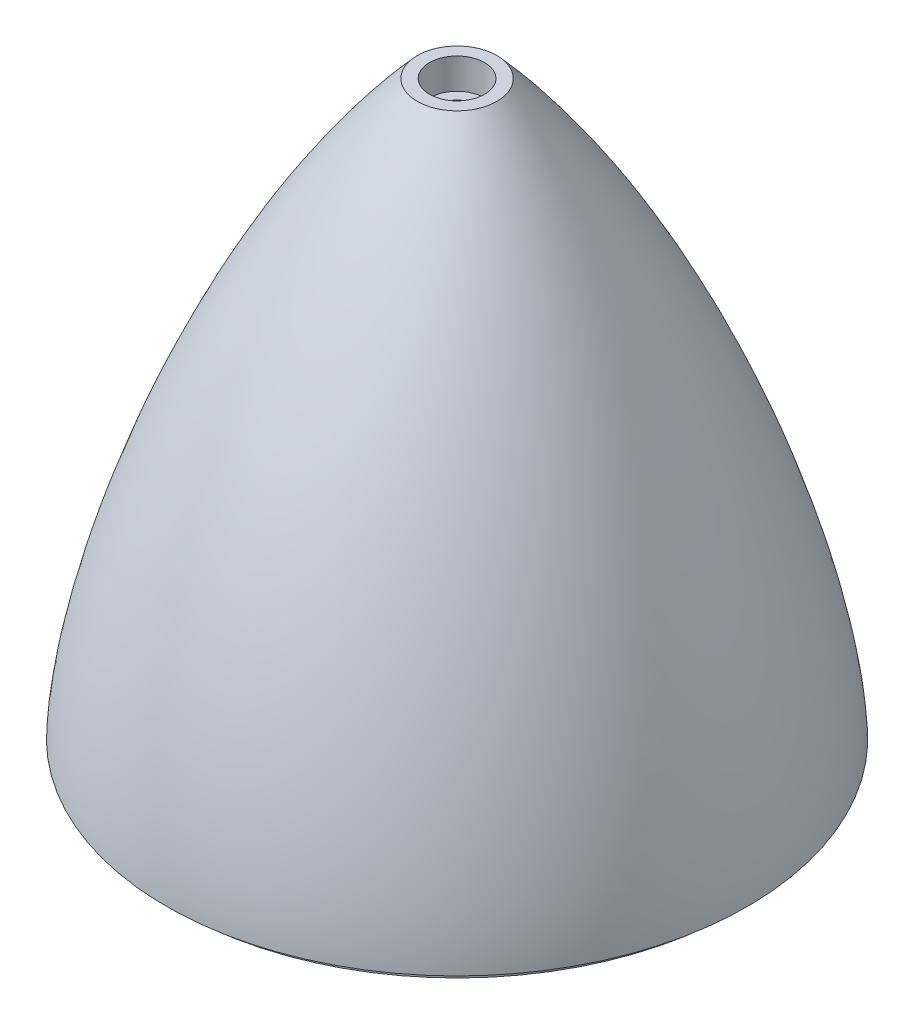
ISO-10303-21;
HEADER;
FILE_DESCRIPTION(('STEP AP214'),'2;1');
FILE_NAME('part.step','',(''),(''),'','','');
FILE_SCHEMA(('AUTOMOTIVE_DESIGN { 1 0 10303 214 1 1 1 1 }'));
ENDSEC;
DATA;
#1=APPLICATION_CONTEXT('core data for automotive mechanical design processes');
#2=APPLICATION_PROTOCOL_DEFINITION('international standard','automotive_design',2000,#1);
#3=PRODUCT_CONTEXT('',#1,'mechanical');
#4=PRODUCT('Part','Part','',(#3));
#5=PRODUCT_RELATED_PRODUCT_CATEGORY('part','',(#4));
#6=PRODUCT_DEFINITION_FORMATION('','',#4);
#7=PRODUCT_DEFINITION_CONTEXT('part definition',#1,'design');
#8=PRODUCT_DEFINITION('design','',#6,#7);
#9=PRODUCT_DEFINITION_SHAPE('','',#8);
#10=(LENGTH_UNIT() NAMED_UNIT(*) SI_UNIT(.MILLI.,.METRE.));
#11=(NAMED_UNIT(*) PLANE_ANGLE_UNIT() SI_UNIT($,.RADIAN.));
#12=(NAMED_UNIT(*) SI_UNIT($,.STERADIAN.) SOLID_ANGLE_UNIT());
#13=UNCERTAINTY_MEASURE_WITH_UNIT(LENGTH_MEASURE(1.E-05),#10,'distance_accuracy_value','');
#14=(GEOMETRIC_REPRESENTATION_CONTEXT(3) GLOBAL_UNCERTAINTY_ASSIGNED_CONTEXT((#13)) GLOBAL_UNIT_ASSIGNED_CONTEXT((#10,
#11,#12)) REPRESENTATION_CONTEXT('',''));
#15=CARTESIAN_POINT('',(0.,0.,0.));
#16=DIRECTION('',(0.,0.,1.));
#17=DIRECTION('',(1.,0.,0.));
#18=AXIS2_PLACEMENT_3D('',#15,#16,#17);
#19=CARTESIAN_POINT('',(-6.5,95.,0.));
#20=CARTESIAN_POINT('',(-33.0362426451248,65.4216191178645,0.));
#21=CARTESIAN_POINT('',(-47.5000000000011,18.3461045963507,0.));
#22=CARTESIAN_POINT('',(-47.5,0.,0.));
#23=B_SPLINE_CURVE_WITH_KNOTS('',3,(#19,#20,#21,#22),.UNSPECIFIED.,.F.,.F.,(4,4),(0.,1.),.UNSPECIFIED.);
#24=CARTESIAN_POINT('',(0.,0.,0.));
#25=DIRECTION('',(0.,-1.,0.));
#26=AXIS1_PLACEMENT('',#24,#25);
#27=SURFACE_OF_REVOLUTION('',#23,#26);
#28=CARTESIAN_POINT('',(0.,95.,0.));
#29=DIRECTION('',(0.,-1.,0.));
#30=DIRECTION('',(0.,0.,-1.));
#31=AXIS2_PLACEMENT_3D('',#28,#29,#30);
#32=CIRCLE('',#31,6.5);
#33=CARTESIAN_POINT('',(0.,95.,-6.5));
#34=VERTEX_POINT('',#33);
#35=EDGE_CURVE('E10',#34,#34,#32,.T.);
#36=ORIENTED_EDGE('',*,*,#35,.T.);
#37=EDGE_LOOP('',(#36));
#38=FACE_BOUND('',#37,.T.);
#39=CARTESIAN_POINT('',(0.,1.5,0.));
#40=DIRECTION('',(0.,-1.,0.));
#41=DIRECTION('',(0.,0.,-1.));
#42=AXIS2_PLACEMENT_3D('',#39,#40,#41);
#43=CIRCLE('',#42,47.4702703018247);
#44=CARTESIAN_POINT('',(0.,1.5,-47.4702703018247));
#45=VERTEX_POINT('',#44);
#46=EDGE_CURVE('E36',#45,#45,#43,.T.);
#47=ORIENTED_EDGE('',*,*,#46,.F.);
#48=EDGE_LOOP('',(#47));
#49=FACE_BOUND('',#48,.T.);
#50=ADVANCED_FACE('F32',(#38,#49),#27,.T.);
#51=CARTESIAN_POINT('',(-44.25,0.,0.));
#52=DIRECTION('',(0.,1.,0.));
#53=DIRECTION('',(0.,0.,1.));
#54=AXIS2_PLACEMENT_3D('',#51,#52,#53);
#55=PLANE('',#54);
#56=CARTESIAN_POINT('',(0.,1.1306474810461E-13,0.));
#57=DIRECTION('',(0.,-1.,0.));
#58=DIRECTION('',(0.,0.,-1.));
#59=AXIS2_PLACEMENT_3D('',#56,#57,#58);
#60=CIRCLE('',#59,44.25);
#61=CARTESIAN_POINT('',(0.,1.1306474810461E-13,-44.25));
#62=VERTEX_POINT('',#61);
#63=EDGE_CURVE('E58',#62,#62,#60,.T.);
#64=ORIENTED_EDGE('',*,*,#63,.F.);
#65=EDGE_LOOP('',(#64));
#66=FACE_BOUND('',#65,.T.);
#67=CARTESIAN_POINT('',(0.,0.,0.));
#68=DIRECTION('',(0.,-1.,0.));
#69=DIRECTION('',(0.,0.,-1.));
#70=AXIS2_PLACEMENT_3D('',#67,#68,#69);
#71=CIRCLE('',#70,45.75);
#72=CARTESIAN_POINT('',(0.,0.,-45.75));
#73=VERTEX_POINT('',#72);
#74=EDGE_CURVE('E112',#73,#73,#71,.T.);
#75=ORIENTED_EDGE('',*,*,#74,.T.);
#76=EDGE_LOOP('',(#75));
#77=FACE_BOUND('',#76,.T.);
#78=ADVANCED_FACE('F79',(#66,#77),#55,.F.);
#79=CARTESIAN_POINT('',(-4.5,95.,0.));
#80=DIRECTION('',(0.,-1.,0.));
#81=DIRECTION('',(0.,0.,-1.));
#82=AXIS2_PLACEMENT_3D('',#79,#80,#81);
#83=PLANE('',#82);
#84=ORIENTED_EDGE('',*,*,#35,.F.);
#85=EDGE_LOOP('',(#84));
#86=FACE_BOUND('',#85,.T.);
#87=CARTESIAN_POINT('',(0.,95.,0.));
#88=DIRECTION('',(0.,-1.,0.));
#89=DIRECTION('',(0.,0.,-1.));
#90=AXIS2_PLACEMENT_3D('',#87,#88,#89);
#91=CIRCLE('',#90,4.5);
#92=CARTESIAN_POINT('',(0.,95.,-4.5));
#93=VERTEX_POINT('',#92);
#94=EDGE_CURVE('E40',#93,#93,#91,.T.);
#95=ORIENTED_EDGE('',*,*,#94,.T.);
#96=EDGE_LOOP('',(#95));
#97=FACE_BOUND('',#96,.T.);
#98=ADVANCED_FACE('F94',(#86,#97),#83,.F.);
#99=CARTESIAN_POINT('',(0.,0.,0.));
#100=DIRECTION('',(0.,-1.,0.));
#101=DIRECTION('',(0.,0.,-1.));
#102=AXIS2_PLACEMENT_3D('',#99,#100,#101);
#103=CYLINDRICAL_SURFACE('',#102,4.5);
#104=ORIENTED_EDGE('',*,*,#94,.F.);
#105=EDGE_LOOP('',(#104));
#106=FACE_BOUND('',#105,.T.);
#107=CARTESIAN_POINT('',(0.,90.,0.));
#108=DIRECTION('',(0.,-1.,0.));
#109=DIRECTION('',(0.,0.,-1.));
#110=AXIS2_PLACEMENT_3D('',#107,#108,#109);
#111=CIRCLE('',#110,4.5);
#112=CARTESIAN_POINT('',(0.,90.,-4.5));
#113=VERTEX_POINT('',#112);
#114=EDGE_CURVE('E44',#113,#113,#111,.T.);
#115=ORIENTED_EDGE('',*,*,#114,.T.);
#116=EDGE_LOOP('',(#115));
#117=FACE_BOUND('',#116,.T.);
#118=ADVANCED_FACE('F91',(#106,#117),#103,.F.);
#119=CARTESIAN_POINT('',(-2.75,90.,0.));
#120=DIRECTION('',(0.,-1.,0.));
#121=DIRECTION('',(0.,0.,-1.));
#122=AXIS2_PLACEMENT_3D('',#119,#120,#121);
#123=PLANE('',#122);
#124=ORIENTED_EDGE('',*,*,#114,.F.);
#125=EDGE_LOOP('',(#124));
#126=FACE_BOUND('',#125,.T.);
#127=CARTESIAN_POINT('',(0.,90.,0.));
#128=DIRECTION('',(0.,-1.,0.));
#129=DIRECTION('',(0.,0.,-1.));
#130=AXIS2_PLACEMENT_3D('',#127,#128,#129);
#131=CIRCLE('',#130,2.75);
#132=CARTESIAN_POINT('',(0.,90.,-2.75));
#133=VERTEX_POINT('',#132);
#134=EDGE_CURVE('E49',#133,#133,#131,.T.);
#135=ORIENTED_EDGE('',*,*,#134,.T.);
#136=EDGE_LOOP('',(#135));
#137=FACE_BOUND('',#136,.T.);
#138=ADVANCED_FACE('F87',(#126,#137),#123,.F.);
#139=CARTESIAN_POINT('',(0.,0.,0.));
#140=DIRECTION('',(0.,-1.,0.));
#141=DIRECTION('',(0.,0.,-1.));
#142=AXIS2_PLACEMENT_3D('',#139,#140,#141);
#143=CYLINDRICAL_SURFACE('',#142,2.75);
#144=ORIENTED_EDGE('',*,*,#134,.F.);
#145=EDGE_LOOP('',(#144));
#146=FACE_BOUND('',#145,.T.);
#147=CARTESIAN_POINT('',(0.,84.,0.));
#148=DIRECTION('',(0.,-1.,0.));
#149=DIRECTION('',(0.,0.,-1.));
#150=AXIS2_PLACEMENT_3D('',#147,#148,#149);
#151=CIRCLE('',#150,2.75);
#152=CARTESIAN_POINT('',(0.,84.,-2.75));
#153=VERTEX_POINT('',#152);
#154=EDGE_CURVE('E52',#153,#153,#151,.T.);
#155=ORIENTED_EDGE('',*,*,#154,.T.);
#156=EDGE_LOOP('',(#155));
#157=FACE_BOUND('',#156,.T.);
#158=ADVANCED_FACE('F83',(#146,#157),#143,.F.);
#159=CARTESIAN_POINT('',(-11.2723578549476,84.,0.));
#160=DIRECTION('',(0.,1.,0.));
#161=DIRECTION('',(0.,0.,1.));
#162=AXIS2_PLACEMENT_3D('',#159,#160,#161);
#163=PLANE('',#162);
#164=ORIENTED_EDGE('',*,*,#154,.F.);
#165=EDGE_LOOP('',(#164));
#166=FACE_BOUND('',#165,.T.);
#167=CARTESIAN_POINT('',(0.,84.,0.));
#168=DIRECTION('',(0.,-1.,0.));
#169=DIRECTION('',(0.,0.,-1.));
#170=AXIS2_PLACEMENT_3D('',#167,#168,#169);
#171=CIRCLE('',#170,11.2723578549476);
#172=CARTESIAN_POINT('',(0.,84.,-11.2723578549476));
#173=VERTEX_POINT('',#172);
#174=EDGE_CURVE('E55',#173,#173,#171,.T.);
#175=ORIENTED_EDGE('',*,*,#174,.T.);
#176=EDGE_LOOP('',(#175));
#177=FACE_BOUND('',#176,.T.);
#178=ADVANCED_FACE('F77',(#166,#177),#163,.F.);
#179=CARTESIAN_POINT('',(-44.25,1.1306474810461E-13,0.));
#180=CARTESIAN_POINT('',(-44.2499998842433,0.26821262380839,0.));
#181=CARTESIAN_POINT('',(-44.2435892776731,0.792876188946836,0.));
#182=CARTESIAN_POINT('',(-44.2045340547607,1.93582999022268,0.));
#183=CARTESIAN_POINT('',(-44.1057084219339,3.4687034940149,0.));
#184=CARTESIAN_POINT('',(-43.905673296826,5.48103163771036,0.));
#185=CARTESIAN_POINT('',(-43.5296618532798,8.37042470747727,0.));
#186=CARTESIAN_POINT('',(-42.8543503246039,12.3432214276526,0.));
#187=CARTESIAN_POINT('',(-41.7172510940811,17.6036469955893,0.));
#188=CARTESIAN_POINT('',(-40.2567621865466,23.2807086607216,0.));
#189=CARTESIAN_POINT('',(-37.8833910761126,31.3075002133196,0.));
#190=CARTESIAN_POINT('',(-34.1280386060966,42.0189956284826,0.));
#191=CARTESIAN_POINT('',(-28.3949157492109,55.3948792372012,0.));
#192=CARTESIAN_POINT('',(-22.6270166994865,66.5134950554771,0.));
#193=CARTESIAN_POINT('',(-17.4409534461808,75.1146558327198,0.));
#194=CARTESIAN_POINT('',(-13.2713408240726,81.3504526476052,0.));
#195=CARTESIAN_POINT('',(-9.57120995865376,86.3081442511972,0.));
#196=CARTESIAN_POINT('',(-6.4750099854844,90.1022572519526,0.));
#197=CARTESIAN_POINT('',(-4.89035239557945,91.9273261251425,0.));
#198=CARTESIAN_POINT('',(-4.08083337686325,92.8296483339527,0.));
#199=B_SPLINE_CURVE_WITH_KNOTS('',3,(#179,#180,#181,#182,#183,#184,#185,#186,#187,#188,#189,
#190,#191,#192,#193,#194,#195,#196,#197,#198),.UNSPECIFIED.,.F.,.F.,(4,1,1,1,1,1,1,1,1,1,1,1,1,
1,1,1,1,4),(0.,0.015625,0.03125,0.0625,0.09375,0.125,0.1875,0.25,0.3125,0.375,0.5,0.625,0.75,
0.8125,0.875,0.9375,0.96875,1.),.UNSPECIFIED.);
#200=CARTESIAN_POINT('',(0.,0.,0.));
#201=DIRECTION('',(0.,-1.,0.));
#202=AXIS1_PLACEMENT('',#200,#201);
#203=SURFACE_OF_REVOLUTION('',#199,#202);
#204=ORIENTED_EDGE('',*,*,#174,.F.);
#205=EDGE_LOOP('',(#204));
#206=FACE_BOUND('',#205,.T.);
#207=ORIENTED_EDGE('',*,*,#63,.T.);
#208=EDGE_LOOP('',(#207));
#209=FACE_BOUND('',#208,.T.);
#210=ADVANCED_FACE('F72',(#206,#209),#203,.T.);
#211=CARTESIAN_POINT('',(-45.75,1.5,0.));
#212=DIRECTION('',(0.,-1.,0.));
#213=DIRECTION('',(0.,0.,-1.));
#214=AXIS2_PLACEMENT_3D('',#211,#212,#213);
#215=PLANE('',#214);
#216=CARTESIAN_POINT('',(0.,1.5,0.));
#217=DIRECTION('',(0.,-1.,0.));
#218=DIRECTION('',(0.,0.,-1.));
#219=AXIS2_PLACEMENT_3D('',#216,#217,#218);
#220=CIRCLE('',#219,45.75);
#221=CARTESIAN_POINT('',(0.,1.5,-45.75));
#222=VERTEX_POINT('',#221);
#223=EDGE_CURVE('E110',#222,#222,#220,.T.);
#224=ORIENTED_EDGE('',*,*,#223,.F.);
#225=EDGE_LOOP('',(#224));
#226=FACE_BOUND('',#225,.T.);
#227=ORIENTED_EDGE('',*,*,#46,.T.);
#228=EDGE_LOOP('',(#227));
#229=FACE_BOUND('',#228,.T.);
#230=ADVANCED_FACE('F76',(#226,#229),#215,.T.);
#231=CARTESIAN_POINT('',(0.,0.,0.));
#232=DIRECTION('',(0.,-1.,0.));
#233=DIRECTION('',(0.,0.,-1.));
#234=AXIS2_PLACEMENT_3D('',#231,#232,#233);
#235=CYLINDRICAL_SURFACE('',#234,45.75);
#236=ORIENTED_EDGE('',*,*,#223,.T.);
#237=EDGE_LOOP('',(#236));
#238=FACE_BOUND('',#237,.T.);
#239=ORIENTED_EDGE('',*,*,#74,.F.);
#240=EDGE_LOOP('',(#239));
#241=FACE_BOUND('',#240,.T.);
#242=ADVANCED_FACE('F120',(#238,#241),#235,.T.);
#243=CLOSED_SHELL('',(#50,#78,#98,#118,#138,#158,#178,#210,#230,#242));
#244=MANIFOLD_SOLID_BREP('B2',#243);
#245=ADVANCED_BREP_SHAPE_REPRESENTATION('',(#18,#244),#14);
#246=SHAPE_DEFINITION_REPRESENTATION(#9,#245);
ENDSEC;
END-ISO-10303-21;
